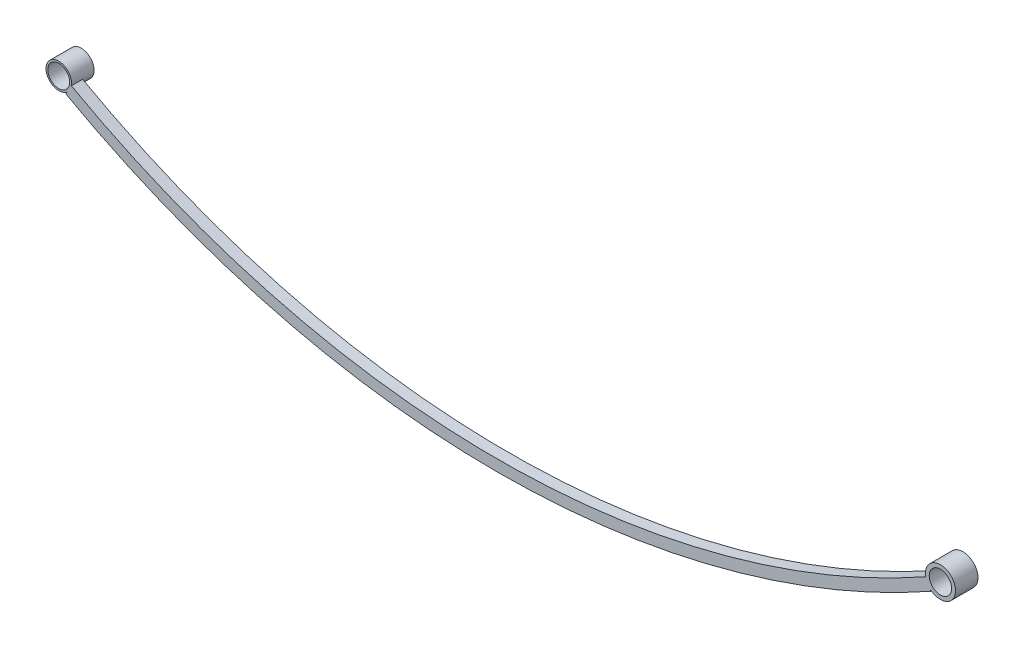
ISO-10303-21;
HEADER;
FILE_DESCRIPTION(('STEP AP214'),'2;1');
FILE_NAME('part.step','',(''),(''),'','','');
FILE_SCHEMA(('AUTOMOTIVE_DESIGN { 1 0 10303 214 1 1 1 1 }'));
ENDSEC;
DATA;
#1=APPLICATION_CONTEXT('core data for automotive mechanical design processes');
#2=APPLICATION_PROTOCOL_DEFINITION('international standard','automotive_design',2000,#1);
#3=PRODUCT_CONTEXT('',#1,'mechanical');
#4=PRODUCT('Part','Part','',(#3));
#5=PRODUCT_RELATED_PRODUCT_CATEGORY('part','',(#4));
#6=PRODUCT_DEFINITION_FORMATION('','',#4);
#7=PRODUCT_DEFINITION_CONTEXT('part definition',#1,'design');
#8=PRODUCT_DEFINITION('design','',#6,#7);
#9=PRODUCT_DEFINITION_SHAPE('','',#8);
#10=(LENGTH_UNIT() NAMED_UNIT(*) SI_UNIT(.MILLI.,.METRE.));
#11=(NAMED_UNIT(*) PLANE_ANGLE_UNIT() SI_UNIT($,.RADIAN.));
#12=(NAMED_UNIT(*) SI_UNIT($,.STERADIAN.) SOLID_ANGLE_UNIT());
#13=UNCERTAINTY_MEASURE_WITH_UNIT(LENGTH_MEASURE(1.E-05),#10,'distance_accuracy_value','');
#14=(GEOMETRIC_REPRESENTATION_CONTEXT(3) GLOBAL_UNCERTAINTY_ASSIGNED_CONTEXT((#13)) GLOBAL_UNIT_ASSIGNED_CONTEXT((#10,
#11,#12)) REPRESENTATION_CONTEXT('',''));
#15=CARTESIAN_POINT('',(0.,0.,0.));
#16=DIRECTION('',(0.,0.,1.));
#17=DIRECTION('',(1.,0.,0.));
#18=AXIS2_PLACEMENT_3D('',#15,#16,#17);
#19=CARTESIAN_POINT('',(-114.911692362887,385.627323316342,10.));
#20=DIRECTION('',(0.,0.,1.));
#21=DIRECTION('',(1.,0.,0.));
#22=AXIS2_PLACEMENT_3D('',#19,#20,#21);
#23=PLANE('',#22);
#24=CARTESIAN_POINT('',(279.256364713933,-290.310979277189,10.));
#25=DIRECTION('',(0.,0.,1.));
#26=DIRECTION('',(1.,0.,0.));
#27=AXIS2_PLACEMENT_3D('',#24,#25,#26);
#28=CIRCLE('',#27,13.3832484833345);
#29=CARTESIAN_POINT('',(270.30293162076,-300.258208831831,10.));
#30=VERTEX_POINT('',#29);
#31=CARTESIAN_POINT('',(266.10278753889,-292.779733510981,10.));
#32=VERTEX_POINT('',#31);
#33=EDGE_CURVE('E46',#30,#32,#28,.F.);
#34=ORIENTED_EDGE('',*,*,#33,.F.);
#35=DIRECTION('',(-0.489685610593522,0.871899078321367,0.));
#36=VECTOR('',#35,1.);
#37=CARTESIAN_POINT('',(266.10278753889,-292.779733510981,10.));
#38=LINE('',#37,#36);
#39=CARTESIAN_POINT('',(270.999643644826,-301.498724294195,10.));
#40=VERTEX_POINT('',#39);
#41=EDGE_CURVE('E126',#40,#30,#38,.T.);
#42=ORIENTED_EDGE('',*,*,#41,.F.);
#43=CARTESIAN_POINT('',(-114.911692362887,385.627323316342,10.));
#44=DIRECTION('',(0.,0.,1.));
#45=DIRECTION('',(1.,0.,0.));
#46=AXIS2_PLACEMENT_3D('',#43,#44,#45);
#47=CIRCLE('',#46,788.07979581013);
#48=CARTESIAN_POINT('',(-497.700488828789,-303.243130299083,10.));
#49=VERTEX_POINT('',#48);
#50=EDGE_CURVE('E123',#49,#40,#47,.T.);
#51=ORIENTED_EDGE('',*,*,#50,.F.);
#52=DIRECTION('',(-0.485723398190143,-0.874112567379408,0.));
#53=VECTOR('',#52,1.);
#54=CARTESIAN_POINT('',(-497.700488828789,-303.243130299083,10.));
#55=LINE('',#54,#53);
#56=CARTESIAN_POINT('',(-496.400084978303,-300.902910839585,10.));
#57=VERTEX_POINT('',#56);
#58=EDGE_CURVE('E121',#57,#49,#55,.T.);
#59=ORIENTED_EDGE('',*,*,#58,.F.);
#60=CARTESIAN_POINT('',(-504.011079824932,-292.484987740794,10.));
#61=DIRECTION('',(0.,0.,1.));
#62=DIRECTION('',(1.,0.,0.));
#63=AXIS2_PLACEMENT_3D('',#60,#61,#62);
#64=CIRCLE('',#63,11.3485096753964);
#65=CARTESIAN_POINT('',(-492.843254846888,-294.502004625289,10.));
#66=VERTEX_POINT('',#65);
#67=EDGE_CURVE('E145',#57,#66,#64,.T.);
#68=ORIENTED_EDGE('',*,*,#67,.T.);
#69=CARTESIAN_POINT('',(-114.911692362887,385.627323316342,10.));
#70=DIRECTION('',(0.,0.,-1.));
#71=DIRECTION('',(1.,0.,0.));
#72=AXIS2_PLACEMENT_3D('',#69,#70,#71);
#73=CIRCLE('',#72,778.07979581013);
#74=EDGE_CURVE('E119',#32,#66,#73,.T.);
#75=ORIENTED_EDGE('',*,*,#74,.F.);
#76=EDGE_LOOP('',(#34,#42,#51,#59,#68,#75));
#77=FACE_BOUND('',#76,.T.);
#78=ADVANCED_FACE('F31',(#77),#23,.F.);
#79=CARTESIAN_POINT('',(266.10278753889,-292.779733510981,10.));
#80=DIRECTION('',(0.871899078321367,0.489685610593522,0.));
#81=DIRECTION('',(-0.489685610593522,0.871899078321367,0.));
#82=AXIS2_PLACEMENT_3D('',#79,#80,#81);
#83=PLANE('',#82);
#84=ORIENTED_EDGE('',*,*,#41,.T.);
#85=DIRECTION('',(0.,0.,-1.));
#86=VECTOR('',#85,1.);
#87=CARTESIAN_POINT('',(270.30293162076,-300.258208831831,20.));
#88=LINE('',#87,#86);
#89=CARTESIAN_POINT('',(270.30293162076,-300.258208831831,20.));
#90=VERTEX_POINT('',#89);
#91=EDGE_CURVE('E11',#30,#90,#88,.F.);
#92=ORIENTED_EDGE('',*,*,#91,.T.);
#93=DIRECTION('',(-0.489685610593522,0.871899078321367,0.));
#94=VECTOR('',#93,1.);
#95=CARTESIAN_POINT('',(266.10278753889,-292.779733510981,20.));
#96=LINE('',#95,#94);
#97=CARTESIAN_POINT('',(270.999643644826,-301.498724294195,20.));
#98=VERTEX_POINT('',#97);
#99=EDGE_CURVE('E108',#98,#90,#96,.T.);
#100=ORIENTED_EDGE('',*,*,#99,.F.);
#101=DIRECTION('',(0.,0.,1.));
#102=VECTOR('',#101,1.);
#103=CARTESIAN_POINT('',(270.999643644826,-301.498724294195,10.));
#104=LINE('',#103,#102);
#105=EDGE_CURVE('E103',#40,#98,#104,.T.);
#106=ORIENTED_EDGE('',*,*,#105,.F.);
#107=EDGE_LOOP('',(#84,#92,#100,#106));
#108=FACE_BOUND('',#107,.T.);
#109=ADVANCED_FACE('F160',(#108),#83,.T.);
#110=CARTESIAN_POINT('',(-504.011079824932,-292.484987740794,20.));
#111=DIRECTION('',(0.,0.,1.));
#112=DIRECTION('',(1.,0.,0.));
#113=AXIS2_PLACEMENT_3D('',#110,#111,#112);
#114=PLANE('',#113);
#115=CARTESIAN_POINT('',(279.256364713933,-290.310979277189,20.));
#116=DIRECTION('',(0.,0.,1.));
#117=DIRECTION('',(1.,0.,0.));
#118=AXIS2_PLACEMENT_3D('',#115,#116,#117);
#119=CIRCLE('',#118,13.3832484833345);
#120=CARTESIAN_POINT('',(266.102787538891,-292.779733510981,20.));
#121=VERTEX_POINT('',#120);
#122=EDGE_CURVE('E101',#90,#121,#119,.T.);
#123=ORIENTED_EDGE('',*,*,#122,.T.);
#124=CARTESIAN_POINT('',(-114.911692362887,385.627323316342,20.));
#125=DIRECTION('',(0.,0.,-1.));
#126=DIRECTION('',(1.,0.,0.));
#127=AXIS2_PLACEMENT_3D('',#124,#125,#126);
#128=CIRCLE('',#127,778.07979581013);
#129=CARTESIAN_POINT('',(-492.843254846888,-294.502004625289,20.));
#130=VERTEX_POINT('',#129);
#131=EDGE_CURVE('E84',#121,#130,#128,.T.);
#132=ORIENTED_EDGE('',*,*,#131,.T.);
#133=CARTESIAN_POINT('',(-504.011079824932,-292.484987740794,20.));
#134=DIRECTION('',(0.,0.,1.));
#135=DIRECTION('',(1.,0.,0.));
#136=AXIS2_PLACEMENT_3D('',#133,#134,#135);
#137=CIRCLE('',#136,11.3485096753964);
#138=CARTESIAN_POINT('',(-496.400084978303,-300.902910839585,20.));
#139=VERTEX_POINT('',#138);
#140=EDGE_CURVE('E143',#130,#139,#137,.T.);
#141=ORIENTED_EDGE('',*,*,#140,.T.);
#142=DIRECTION('',(-0.485723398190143,-0.874112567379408,0.));
#143=VECTOR('',#142,1.);
#144=CARTESIAN_POINT('',(-497.700488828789,-303.243130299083,20.));
#145=LINE('',#144,#143);
#146=CARTESIAN_POINT('',(-497.700488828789,-303.243130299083,20.));
#147=VERTEX_POINT('',#146);
#148=EDGE_CURVE('E95',#139,#147,#145,.T.);
#149=ORIENTED_EDGE('',*,*,#148,.T.);
#150=CARTESIAN_POINT('',(-114.911692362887,385.627323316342,20.));
#151=DIRECTION('',(0.,0.,1.));
#152=DIRECTION('',(1.,0.,0.));
#153=AXIS2_PLACEMENT_3D('',#150,#151,#152);
#154=CIRCLE('',#153,788.07979581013);
#155=EDGE_CURVE('E129',#147,#98,#154,.T.);
#156=ORIENTED_EDGE('',*,*,#155,.T.);
#157=ORIENTED_EDGE('',*,*,#99,.T.);
#158=EDGE_LOOP('',(#123,#132,#141,#149,#156,#157));
#159=FACE_BOUND('',#158,.T.);
#160=CARTESIAN_POINT('',(279.256364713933,-290.310979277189,20.));
#161=DIRECTION('',(0.,0.,1.));
#162=DIRECTION('',(1.,0.,0.));
#163=AXIS2_PLACEMENT_3D('',#160,#161,#162);
#164=CIRCLE('',#163,9.95541420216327);
#165=CARTESIAN_POINT('',(289.211778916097,-290.310979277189,20.));
#166=VERTEX_POINT('',#165);
#167=EDGE_CURVE('E113',#166,#166,#164,.T.);
#168=ORIENTED_EDGE('',*,*,#167,.F.);
#169=EDGE_LOOP('',(#168));
#170=FACE_BOUND('',#169,.T.);
#171=CARTESIAN_POINT('',(-504.011079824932,-292.484987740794,20.));
#172=DIRECTION('',(0.,0.,1.));
#173=DIRECTION('',(1.,0.,0.));
#174=AXIS2_PLACEMENT_3D('',#171,#172,#173);
#175=CIRCLE('',#174,9.74583405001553);
#176=CARTESIAN_POINT('',(-494.265245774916,-292.484987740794,20.));
#177=VERTEX_POINT('',#176);
#178=EDGE_CURVE('E137',#177,#177,#175,.T.);
#179=ORIENTED_EDGE('',*,*,#178,.F.);
#180=EDGE_LOOP('',(#179));
#181=FACE_BOUND('',#180,.T.);
#182=ADVANCED_FACE('F105',(#159,#170,#181),#114,.T.);
#183=CARTESIAN_POINT('',(-504.011079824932,-292.484987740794,0.));
#184=DIRECTION('',(0.,0.,1.));
#185=DIRECTION('',(1.,0.,0.));
#186=AXIS2_PLACEMENT_3D('',#183,#184,#185);
#187=PLANE('',#186);
#188=CARTESIAN_POINT('',(-504.011079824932,-292.484987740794,0.));
#189=DIRECTION('',(0.,0.,1.));
#190=DIRECTION('',(1.,0.,0.));
#191=AXIS2_PLACEMENT_3D('',#188,#189,#190);
#192=CIRCLE('',#191,11.3485096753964);
#193=CARTESIAN_POINT('',(-492.662570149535,-292.484987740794,0.));
#194=VERTEX_POINT('',#193);
#195=EDGE_CURVE('E140',#194,#194,#192,.T.);
#196=ORIENTED_EDGE('',*,*,#195,.F.);
#197=EDGE_LOOP('',(#196));
#198=FACE_BOUND('',#197,.T.);
#199=CARTESIAN_POINT('',(-504.011079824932,-292.484987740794,0.));
#200=DIRECTION('',(0.,0.,1.));
#201=DIRECTION('',(1.,0.,0.));
#202=AXIS2_PLACEMENT_3D('',#199,#200,#201);
#203=CIRCLE('',#202,9.74583405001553);
#204=CARTESIAN_POINT('',(-494.265245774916,-292.484987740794,0.));
#205=VERTEX_POINT('',#204);
#206=EDGE_CURVE('E102',#205,#205,#203,.T.);
#207=ORIENTED_EDGE('',*,*,#206,.T.);
#208=EDGE_LOOP('',(#207));
#209=FACE_BOUND('',#208,.T.);
#210=ADVANCED_FACE('F182',(#198,#209),#187,.F.);
#211=CARTESIAN_POINT('',(-504.011079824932,-292.484987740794,20.));
#212=DIRECTION('',(0.,0.,-1.));
#213=DIRECTION('',(-1.,0.,0.));
#214=AXIS2_PLACEMENT_3D('',#211,#212,#213);
#215=CYLINDRICAL_SURFACE('',#214,11.3485096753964);
#216=ORIENTED_EDGE('',*,*,#140,.F.);
#217=DIRECTION('',(0.,0.,1.));
#218=VECTOR('',#217,1.);
#219=CARTESIAN_POINT('',(-492.843254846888,-294.502004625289,10.));
#220=LINE('',#219,#218);
#221=EDGE_CURVE('E90',#66,#130,#220,.T.);
#222=ORIENTED_EDGE('',*,*,#221,.F.);
#223=ORIENTED_EDGE('',*,*,#67,.F.);
#224=DIRECTION('',(0.,0.,-1.));
#225=VECTOR('',#224,1.);
#226=CARTESIAN_POINT('',(-496.400084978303,-300.902910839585,20.));
#227=LINE('',#226,#225);
#228=EDGE_CURVE('E39',#57,#139,#227,.F.);
#229=ORIENTED_EDGE('',*,*,#228,.T.);
#230=EDGE_LOOP('',(#216,#222,#223,#229));
#231=FACE_BOUND('',#230,.T.);
#232=ORIENTED_EDGE('',*,*,#195,.T.);
#233=EDGE_LOOP('',(#232));
#234=FACE_BOUND('',#233,.T.);
#235=ADVANCED_FACE('F33',(#231,#234),#215,.T.);
#236=CARTESIAN_POINT('',(-504.011079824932,-292.484987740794,20.));
#237=DIRECTION('',(0.,0.,-1.));
#238=DIRECTION('',(-1.,0.,0.));
#239=AXIS2_PLACEMENT_3D('',#236,#237,#238);
#240=CYLINDRICAL_SURFACE('',#239,9.74583405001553);
#241=ORIENTED_EDGE('',*,*,#178,.T.);
#242=EDGE_LOOP('',(#241));
#243=FACE_BOUND('',#242,.T.);
#244=ORIENTED_EDGE('',*,*,#206,.F.);
#245=EDGE_LOOP('',(#244));
#246=FACE_BOUND('',#245,.T.);
#247=ADVANCED_FACE('F175',(#243,#246),#240,.F.);
#248=CARTESIAN_POINT('',(-497.700488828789,-303.243130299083,10.));
#249=DIRECTION('',(-0.874112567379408,0.485723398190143,0.));
#250=DIRECTION('',(-0.485723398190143,-0.874112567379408,0.));
#251=AXIS2_PLACEMENT_3D('',#248,#249,#250);
#252=PLANE('',#251);
#253=ORIENTED_EDGE('',*,*,#228,.F.);
#254=ORIENTED_EDGE('',*,*,#58,.T.);
#255=DIRECTION('',(0.,0.,1.));
#256=VECTOR('',#255,1.);
#257=CARTESIAN_POINT('',(-497.700488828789,-303.243130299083,10.));
#258=LINE('',#257,#256);
#259=EDGE_CURVE('E133',#49,#147,#258,.T.);
#260=ORIENTED_EDGE('',*,*,#259,.T.);
#261=ORIENTED_EDGE('',*,*,#148,.F.);
#262=EDGE_LOOP('',(#253,#254,#260,#261));
#263=FACE_BOUND('',#262,.T.);
#264=ADVANCED_FACE('F156',(#263),#252,.T.);
#265=CARTESIAN_POINT('',(-114.911692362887,385.627323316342,10.));
#266=DIRECTION('',(0.,0.,1.));
#267=DIRECTION('',(1.,0.,0.));
#268=AXIS2_PLACEMENT_3D('',#265,#266,#267);
#269=CYLINDRICAL_SURFACE('',#268,778.07979581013);
#270=ORIENTED_EDGE('',*,*,#131,.F.);
#271=DIRECTION('',(0.,0.,1.));
#272=VECTOR('',#271,1.);
#273=CARTESIAN_POINT('',(266.10278753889,-292.779733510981,10.));
#274=LINE('',#273,#272);
#275=EDGE_CURVE('E88',#32,#121,#274,.T.);
#276=ORIENTED_EDGE('',*,*,#275,.F.);
#277=ORIENTED_EDGE('',*,*,#74,.T.);
#278=ORIENTED_EDGE('',*,*,#221,.T.);
#279=EDGE_LOOP('',(#270,#276,#277,#278));
#280=FACE_BOUND('',#279,.T.);
#281=ADVANCED_FACE('F86',(#280),#269,.F.);
#282=CARTESIAN_POINT('',(-114.911692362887,385.627323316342,10.));
#283=DIRECTION('',(0.,0.,1.));
#284=DIRECTION('',(1.,0.,0.));
#285=AXIS2_PLACEMENT_3D('',#282,#283,#284);
#286=CYLINDRICAL_SURFACE('',#285,788.07979581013);
#287=ORIENTED_EDGE('',*,*,#155,.F.);
#288=ORIENTED_EDGE('',*,*,#259,.F.);
#289=ORIENTED_EDGE('',*,*,#50,.T.);
#290=ORIENTED_EDGE('',*,*,#105,.T.);
#291=EDGE_LOOP('',(#287,#288,#289,#290));
#292=FACE_BOUND('',#291,.T.);
#293=ADVANCED_FACE('F159',(#292),#286,.T.);
#294=CARTESIAN_POINT('',(279.256364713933,-290.310979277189,0.));
#295=DIRECTION('',(0.,0.,1.));
#296=DIRECTION('',(1.,0.,0.));
#297=AXIS2_PLACEMENT_3D('',#294,#295,#296);
#298=PLANE('',#297);
#299=CARTESIAN_POINT('',(279.256364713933,-290.310979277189,0.));
#300=DIRECTION('',(0.,0.,1.));
#301=DIRECTION('',(1.,0.,0.));
#302=AXIS2_PLACEMENT_3D('',#299,#300,#301);
#303=CIRCLE('',#302,13.3832484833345);
#304=CARTESIAN_POINT('',(292.639613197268,-290.310979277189,0.));
#305=VERTEX_POINT('',#304);
#306=EDGE_CURVE('E109',#305,#305,#303,.T.);
#307=ORIENTED_EDGE('',*,*,#306,.F.);
#308=EDGE_LOOP('',(#307));
#309=FACE_BOUND('',#308,.T.);
#310=CARTESIAN_POINT('',(279.256364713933,-290.310979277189,0.));
#311=DIRECTION('',(0.,0.,1.));
#312=DIRECTION('',(1.,0.,0.));
#313=AXIS2_PLACEMENT_3D('',#310,#311,#312);
#314=CIRCLE('',#313,9.95541420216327);
#315=CARTESIAN_POINT('',(289.211778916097,-290.310979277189,0.));
#316=VERTEX_POINT('',#315);
#317=EDGE_CURVE('E116',#316,#316,#314,.T.);
#318=ORIENTED_EDGE('',*,*,#317,.T.);
#319=EDGE_LOOP('',(#318));
#320=FACE_BOUND('',#319,.T.);
#321=ADVANCED_FACE('F172',(#309,#320),#298,.F.);
#322=CARTESIAN_POINT('',(279.256364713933,-290.310979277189,20.));
#323=DIRECTION('',(0.,0.,-1.));
#324=DIRECTION('',(-1.,0.,0.));
#325=AXIS2_PLACEMENT_3D('',#322,#323,#324);
#326=CYLINDRICAL_SURFACE('',#325,13.3832484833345);
#327=ORIENTED_EDGE('',*,*,#91,.F.);
#328=ORIENTED_EDGE('',*,*,#33,.T.);
#329=ORIENTED_EDGE('',*,*,#275,.T.);
#330=ORIENTED_EDGE('',*,*,#122,.F.);
#331=EDGE_LOOP('',(#327,#328,#329,#330));
#332=FACE_BOUND('',#331,.T.);
#333=ORIENTED_EDGE('',*,*,#306,.T.);
#334=EDGE_LOOP('',(#333));
#335=FACE_BOUND('',#334,.T.);
#336=ADVANCED_FACE('F99',(#332,#335),#326,.T.);
#337=CARTESIAN_POINT('',(279.256364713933,-290.310979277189,20.));
#338=DIRECTION('',(0.,0.,-1.));
#339=DIRECTION('',(-1.,0.,0.));
#340=AXIS2_PLACEMENT_3D('',#337,#338,#339);
#341=CYLINDRICAL_SURFACE('',#340,9.95541420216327);
#342=ORIENTED_EDGE('',*,*,#167,.T.);
#343=EDGE_LOOP('',(#342));
#344=FACE_BOUND('',#343,.T.);
#345=ORIENTED_EDGE('',*,*,#317,.F.);
#346=EDGE_LOOP('',(#345));
#347=FACE_BOUND('',#346,.T.);
#348=ADVANCED_FACE('F223',(#344,#347),#341,.F.);
#349=CLOSED_SHELL('',(#78,#109,#182,#210,#235,#247,#264,#281,#293,#321,#336,#348));
#350=MANIFOLD_SOLID_BREP('B2',#349);
#351=ADVANCED_BREP_SHAPE_REPRESENTATION('',(#18,#350),#14);
#352=SHAPE_DEFINITION_REPRESENTATION(#9,#351);
ENDSEC;
END-ISO-10303-21;
